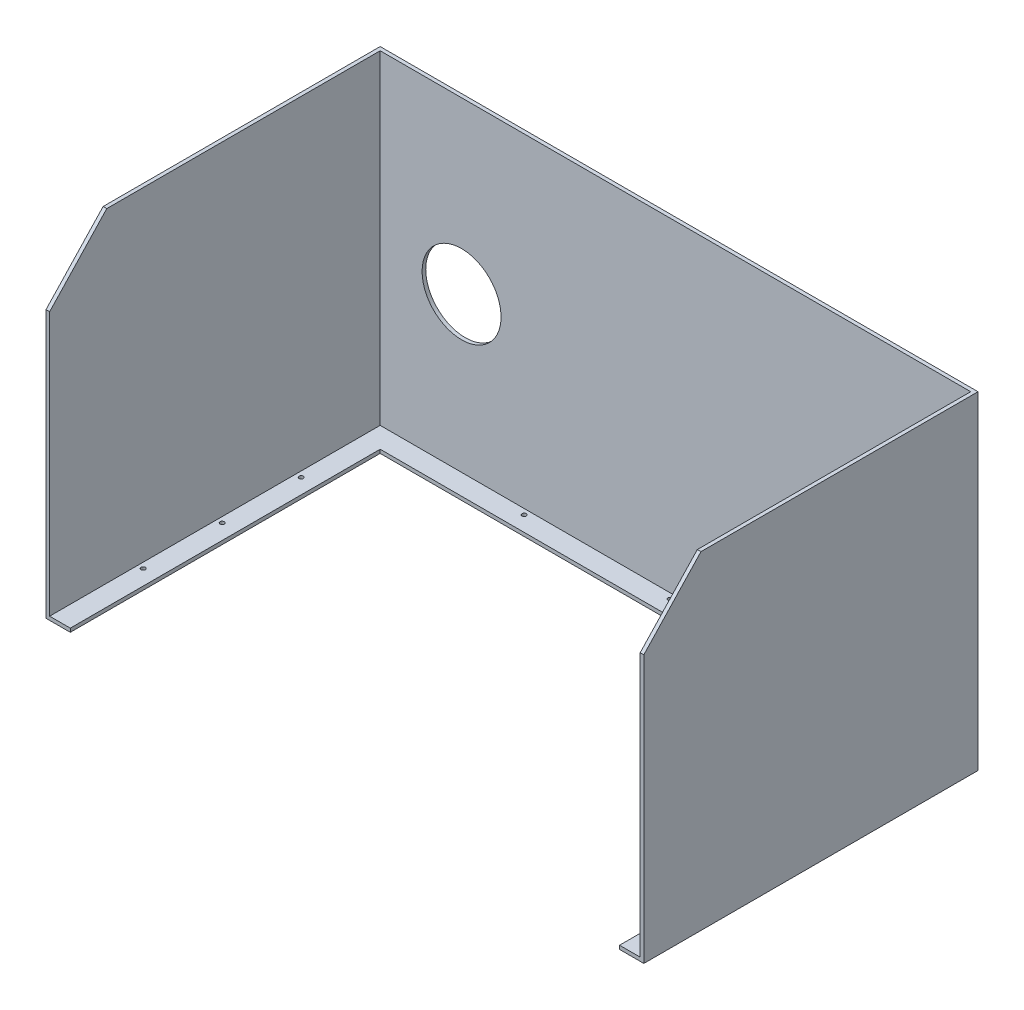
ISO-10303-21;
HEADER;
FILE_DESCRIPTION(('STEP AP214'),'2;1');
FILE_NAME('part.step','',(''),(''),'','','');
FILE_SCHEMA(('AUTOMOTIVE_DESIGN { 1 0 10303 214 1 1 1 1 }'));
ENDSEC;
DATA;
#1=APPLICATION_CONTEXT('core data for automotive mechanical design processes');
#2=APPLICATION_PROTOCOL_DEFINITION('international standard','automotive_design',2000,#1);
#3=PRODUCT_CONTEXT('',#1,'mechanical');
#4=PRODUCT('Part','Part','',(#3));
#5=PRODUCT_RELATED_PRODUCT_CATEGORY('part','',(#4));
#6=PRODUCT_DEFINITION_FORMATION('','',#4);
#7=PRODUCT_DEFINITION_CONTEXT('part definition',#1,'design');
#8=PRODUCT_DEFINITION('design','',#6,#7);
#9=PRODUCT_DEFINITION_SHAPE('','',#8);
#10=(LENGTH_UNIT() NAMED_UNIT(*) SI_UNIT(.MILLI.,.METRE.));
#11=(NAMED_UNIT(*) PLANE_ANGLE_UNIT() SI_UNIT($,.RADIAN.));
#12=(NAMED_UNIT(*) SI_UNIT($,.STERADIAN.) SOLID_ANGLE_UNIT());
#13=UNCERTAINTY_MEASURE_WITH_UNIT(LENGTH_MEASURE(1.E-05),#10,'distance_accuracy_value','');
#14=(GEOMETRIC_REPRESENTATION_CONTEXT(3) GLOBAL_UNCERTAINTY_ASSIGNED_CONTEXT((#13)) GLOBAL_UNIT_ASSIGNED_CONTEXT((#10,
#11,#12)) REPRESENTATION_CONTEXT('',''));
#15=CARTESIAN_POINT('',(0.,0.,0.));
#16=DIRECTION('',(0.,0.,1.));
#17=DIRECTION('',(1.,0.,0.));
#18=AXIS2_PLACEMENT_3D('',#15,#16,#17);
#19=CARTESIAN_POINT('',(-246.,135.,3.));
#20=DIRECTION('',(1.,0.,0.));
#21=DIRECTION('',(0.,1.,0.));
#22=AXIS2_PLACEMENT_3D('',#19,#20,#21);
#23=PLANE('',#22);
#24=DIRECTION('',(0.,-1.,0.));
#25=VECTOR('',#24,1.);
#26=CARTESIAN_POINT('',(-246.,135.,0.));
#27=LINE('',#26,#25);
#28=CARTESIAN_POINT('',(-246.,135.,0.));
#29=VERTEX_POINT('',#28);
#30=CARTESIAN_POINT('',(-246.,-135.,0.));
#31=VERTEX_POINT('',#30);
#32=EDGE_CURVE('E205',#29,#31,#27,.T.);
#33=ORIENTED_EDGE('',*,*,#32,.T.);
#34=DIRECTION('',(0.,0.,-1.));
#35=VECTOR('',#34,1.);
#36=CARTESIAN_POINT('',(-246.,-135.,3.));
#37=LINE('',#36,#35);
#38=CARTESIAN_POINT('',(-246.,-135.,275.));
#39=VERTEX_POINT('',#38);
#40=EDGE_CURVE('E11',#39,#31,#37,.T.);
#41=ORIENTED_EDGE('',*,*,#40,.F.);
#42=DIRECTION('',(0.,1.,0.));
#43=VECTOR('',#42,1.);
#44=CARTESIAN_POINT('',(-246.,-135.,275.));
#45=LINE('',#44,#43);
#46=CARTESIAN_POINT('',(-246.,84.9999999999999,275.));
#47=VERTEX_POINT('',#46);
#48=EDGE_CURVE('E182',#39,#47,#45,.T.);
#49=ORIENTED_EDGE('',*,*,#48,.T.);
#50=DIRECTION('',(0.,0.728627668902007,-0.684910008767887));
#51=VECTOR('',#50,1.);
#52=CARTESIAN_POINT('',(-246.,135.,228.));
#53=LINE('',#52,#51);
#54=CARTESIAN_POINT('',(-246.,135.,228.));
#55=VERTEX_POINT('',#54);
#56=EDGE_CURVE('E190',#47,#55,#53,.T.);
#57=ORIENTED_EDGE('',*,*,#56,.T.);
#58=DIRECTION('',(0.,0.,-1.));
#59=VECTOR('',#58,1.);
#60=CARTESIAN_POINT('',(-246.,135.,3.));
#61=LINE('',#60,#59);
#62=EDGE_CURVE('E212',#55,#29,#61,.T.);
#63=ORIENTED_EDGE('',*,*,#62,.T.);
#64=EDGE_LOOP('',(#33,#41,#49,#57,#63));
#65=FACE_BOUND('',#64,.T.);
#66=ADVANCED_FACE('F36',(#65),#23,.F.);
#67=CARTESIAN_POINT('',(246.,-135.,3.));
#68=DIRECTION('',(0.,1.,0.));
#69=DIRECTION('',(-1.,0.,0.));
#70=AXIS2_PLACEMENT_3D('',#67,#68,#69);
#71=PLANE('',#70);
#72=CARTESIAN_POINT('',(-238.5,-135.,137.5));
#73=DIRECTION('',(0.,-1.,0.));
#74=DIRECTION('',(1.,0.,0.));
#75=AXIS2_PLACEMENT_3D('',#72,#73,#74);
#76=CIRCLE('',#75,1.75000000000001);
#77=CARTESIAN_POINT('',(-236.75,-135.,137.5));
#78=VERTEX_POINT('',#77);
#79=EDGE_CURVE('E343',#78,#78,#76,.T.);
#80=ORIENTED_EDGE('',*,*,#79,.F.);
#81=EDGE_LOOP('',(#80));
#82=FACE_BOUND('',#81,.T.);
#83=CARTESIAN_POINT('',(-238.5,-135.,72.5));
#84=DIRECTION('',(0.,-1.,0.));
#85=DIRECTION('',(1.,0.,0.));
#86=AXIS2_PLACEMENT_3D('',#83,#84,#85);
#87=CIRCLE('',#86,1.75000000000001);
#88=CARTESIAN_POINT('',(-236.75,-135.,72.5));
#89=VERTEX_POINT('',#88);
#90=EDGE_CURVE('E337',#89,#89,#87,.T.);
#91=ORIENTED_EDGE('',*,*,#90,.F.);
#92=EDGE_LOOP('',(#91));
#93=FACE_BOUND('',#92,.T.);
#94=CARTESIAN_POINT('',(-120.,-135.,7.50000000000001));
#95=DIRECTION('',(0.,-1.,0.));
#96=DIRECTION('',(1.,0.,0.));
#97=AXIS2_PLACEMENT_3D('',#94,#95,#96);
#98=CIRCLE('',#97,1.75000000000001);
#99=CARTESIAN_POINT('',(-118.25,-135.,7.50000000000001));
#100=VERTEX_POINT('',#99);
#101=EDGE_CURVE('E331',#100,#100,#98,.T.);
#102=ORIENTED_EDGE('',*,*,#101,.F.);
#103=EDGE_LOOP('',(#102));
#104=FACE_BOUND('',#103,.T.);
#105=CARTESIAN_POINT('',(0.,-135.,7.5));
#106=DIRECTION('',(0.,-1.,0.));
#107=DIRECTION('',(1.,0.,0.));
#108=AXIS2_PLACEMENT_3D('',#105,#106,#107);
#109=CIRCLE('',#108,1.75);
#110=CARTESIAN_POINT('',(1.74999999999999,-135.,7.5));
#111=VERTEX_POINT('',#110);
#112=EDGE_CURVE('E314',#111,#111,#109,.T.);
#113=ORIENTED_EDGE('',*,*,#112,.F.);
#114=EDGE_LOOP('',(#113));
#115=FACE_BOUND('',#114,.T.);
#116=CARTESIAN_POINT('',(238.5,-135.,72.5));
#117=DIRECTION('',(0.,-1.,0.));
#118=DIRECTION('',(1.,0.,0.));
#119=AXIS2_PLACEMENT_3D('',#116,#117,#118);
#120=CIRCLE('',#119,1.75000000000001);
#121=CARTESIAN_POINT('',(240.25,-135.,72.5));
#122=VERTEX_POINT('',#121);
#123=EDGE_CURVE('E315',#122,#122,#120,.T.);
#124=ORIENTED_EDGE('',*,*,#123,.F.);
#125=EDGE_LOOP('',(#124));
#126=FACE_BOUND('',#125,.T.);
#127=CARTESIAN_POINT('',(238.5,-135.,137.5));
#128=DIRECTION('',(0.,-1.,0.));
#129=DIRECTION('',(1.,0.,0.));
#130=AXIS2_PLACEMENT_3D('',#127,#128,#129);
#131=CIRCLE('',#130,1.75000000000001);
#132=CARTESIAN_POINT('',(240.25,-135.,137.5));
#133=VERTEX_POINT('',#132);
#134=EDGE_CURVE('E321',#133,#133,#131,.T.);
#135=ORIENTED_EDGE('',*,*,#134,.F.);
#136=EDGE_LOOP('',(#135));
#137=FACE_BOUND('',#136,.T.);
#138=CARTESIAN_POINT('',(238.5,-135.,202.5));
#139=DIRECTION('',(0.,-1.,0.));
#140=DIRECTION('',(1.,0.,0.));
#141=AXIS2_PLACEMENT_3D('',#138,#139,#140);
#142=CIRCLE('',#141,1.75000000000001);
#143=CARTESIAN_POINT('',(240.25,-135.,202.5));
#144=VERTEX_POINT('',#143);
#145=EDGE_CURVE('E301',#144,#144,#142,.T.);
#146=ORIENTED_EDGE('',*,*,#145,.F.);
#147=EDGE_LOOP('',(#146));
#148=FACE_BOUND('',#147,.T.);
#149=CARTESIAN_POINT('',(120.,-135.,7.5));
#150=DIRECTION('',(0.,-1.,0.));
#151=DIRECTION('',(1.,0.,0.));
#152=AXIS2_PLACEMENT_3D('',#149,#150,#151);
#153=CIRCLE('',#152,1.75000000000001);
#154=CARTESIAN_POINT('',(121.75,-135.,7.5));
#155=VERTEX_POINT('',#154);
#156=EDGE_CURVE('E308',#155,#155,#153,.T.);
#157=ORIENTED_EDGE('',*,*,#156,.F.);
#158=EDGE_LOOP('',(#157));
#159=FACE_BOUND('',#158,.T.);
#160=CARTESIAN_POINT('',(-238.5,-135.,202.5));
#161=DIRECTION('',(0.,-1.,0.));
#162=DIRECTION('',(1.,0.,0.));
#163=AXIS2_PLACEMENT_3D('',#160,#161,#162);
#164=CIRCLE('',#163,1.75000000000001);
#165=CARTESIAN_POINT('',(-236.75,-135.,202.5));
#166=VERTEX_POINT('',#165);
#167=EDGE_CURVE('E295',#166,#166,#164,.T.);
#168=ORIENTED_EDGE('',*,*,#167,.F.);
#169=EDGE_LOOP('',(#168));
#170=FACE_BOUND('',#169,.T.);
#171=DIRECTION('',(0.,0.,1.));
#172=VECTOR('',#171,1.);
#173=CARTESIAN_POINT('',(-226.,-135.,275.));
#174=LINE('',#173,#172);
#175=CARTESIAN_POINT('',(-226.,-135.,20.));
#176=VERTEX_POINT('',#175);
#177=CARTESIAN_POINT('',(-226.,-135.,275.));
#178=VERTEX_POINT('',#177);
#179=EDGE_CURVE('E153',#176,#178,#174,.T.);
#180=ORIENTED_EDGE('',*,*,#179,.T.);
#181=DIRECTION('',(-1.,0.,0.));
#182=VECTOR('',#181,1.);
#183=CARTESIAN_POINT('',(-243.,-135.,275.));
#184=LINE('',#183,#182);
#185=EDGE_CURVE('E197',#178,#39,#184,.T.);
#186=ORIENTED_EDGE('',*,*,#185,.T.);
#187=ORIENTED_EDGE('',*,*,#40,.T.);
#188=DIRECTION('',(1.,0.,0.));
#189=VECTOR('',#188,1.);
#190=CARTESIAN_POINT('',(246.,-135.,0.));
#191=LINE('',#190,#189);
#192=CARTESIAN_POINT('',(246.,-135.,0.));
#193=VERTEX_POINT('',#192);
#194=EDGE_CURVE('E215',#31,#193,#191,.T.);
#195=ORIENTED_EDGE('',*,*,#194,.T.);
#196=DIRECTION('',(0.,0.,-1.));
#197=VECTOR('',#196,1.);
#198=CARTESIAN_POINT('',(246.,-135.,3.));
#199=LINE('',#198,#197);
#200=CARTESIAN_POINT('',(246.,-135.,275.));
#201=VERTEX_POINT('',#200);
#202=EDGE_CURVE('E43',#201,#193,#199,.T.);
#203=ORIENTED_EDGE('',*,*,#202,.F.);
#204=DIRECTION('',(1.,0.,0.));
#205=VECTOR('',#204,1.);
#206=CARTESIAN_POINT('',(243.,-135.,275.));
#207=LINE('',#206,#205);
#208=CARTESIAN_POINT('',(226.,-135.,275.));
#209=VERTEX_POINT('',#208);
#210=EDGE_CURVE('E179',#209,#201,#207,.T.);
#211=ORIENTED_EDGE('',*,*,#210,.F.);
#212=DIRECTION('',(0.,0.,-1.));
#213=VECTOR('',#212,1.);
#214=CARTESIAN_POINT('',(226.,-135.,275.));
#215=LINE('',#214,#213);
#216=CARTESIAN_POINT('',(226.,-135.,20.));
#217=VERTEX_POINT('',#216);
#218=EDGE_CURVE('E253',#209,#217,#215,.T.);
#219=ORIENTED_EDGE('',*,*,#218,.T.);
#220=DIRECTION('',(-1.,0.,0.));
#221=VECTOR('',#220,1.);
#222=CARTESIAN_POINT('',(226.,-135.,20.));
#223=LINE('',#222,#221);
#224=EDGE_CURVE('E255',#217,#176,#223,.T.);
#225=ORIENTED_EDGE('',*,*,#224,.T.);
#226=EDGE_LOOP('',(#180,#186,#187,#195,#203,#211,#219,#225));
#227=FACE_BOUND('',#226,.T.);
#228=ADVANCED_FACE('F251',(#82,#93,#104,#115,#126,#137,#148,#159,#170,#227),#71,.F.);
#229=CARTESIAN_POINT('',(246.,135.,3.));
#230=DIRECTION('',(-1.,0.,0.));
#231=DIRECTION('',(0.,-1.,0.));
#232=AXIS2_PLACEMENT_3D('',#229,#230,#231);
#233=PLANE('',#232);
#234=DIRECTION('',(0.,1.,0.));
#235=VECTOR('',#234,1.);
#236=CARTESIAN_POINT('',(246.,135.,0.));
#237=LINE('',#236,#235);
#238=CARTESIAN_POINT('',(246.,135.,0.));
#239=VERTEX_POINT('',#238);
#240=EDGE_CURVE('E217',#193,#239,#237,.T.);
#241=ORIENTED_EDGE('',*,*,#240,.T.);
#242=DIRECTION('',(0.,0.,-1.));
#243=VECTOR('',#242,1.);
#244=CARTESIAN_POINT('',(246.,135.,3.));
#245=LINE('',#244,#243);
#246=CARTESIAN_POINT('',(246.,135.,228.));
#247=VERTEX_POINT('',#246);
#248=EDGE_CURVE('E221',#247,#239,#245,.T.);
#249=ORIENTED_EDGE('',*,*,#248,.F.);
#250=DIRECTION('',(0.,-0.728627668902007,0.684910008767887));
#251=VECTOR('',#250,1.);
#252=CARTESIAN_POINT('',(246.,85.,275.));
#253=LINE('',#252,#251);
#254=CARTESIAN_POINT('',(246.,85.,275.));
#255=VERTEX_POINT('',#254);
#256=EDGE_CURVE('E165',#247,#255,#253,.T.);
#257=ORIENTED_EDGE('',*,*,#256,.T.);
#258=DIRECTION('',(0.,-1.,0.));
#259=VECTOR('',#258,1.);
#260=CARTESIAN_POINT('',(246.,-135.,275.));
#261=LINE('',#260,#259);
#262=EDGE_CURVE('E160',#255,#201,#261,.T.);
#263=ORIENTED_EDGE('',*,*,#262,.T.);
#264=ORIENTED_EDGE('',*,*,#202,.T.);
#265=EDGE_LOOP('',(#241,#249,#257,#263,#264));
#266=FACE_BOUND('',#265,.T.);
#267=ADVANCED_FACE('F225',(#266),#233,.F.);
#268=CARTESIAN_POINT('',(246.,135.,3.));
#269=DIRECTION('',(0.,-1.,0.));
#270=DIRECTION('',(1.,0.,0.));
#271=AXIS2_PLACEMENT_3D('',#268,#269,#270);
#272=PLANE('',#271);
#273=DIRECTION('',(-1.,0.,0.));
#274=VECTOR('',#273,1.);
#275=CARTESIAN_POINT('',(246.,135.,0.));
#276=LINE('',#275,#274);
#277=EDGE_CURVE('E58',#239,#29,#276,.T.);
#278=ORIENTED_EDGE('',*,*,#277,.T.);
#279=ORIENTED_EDGE('',*,*,#62,.F.);
#280=DIRECTION('',(-1.,0.,0.));
#281=VECTOR('',#280,1.);
#282=CARTESIAN_POINT('',(-243.,135.,228.));
#283=LINE('',#282,#281);
#284=CARTESIAN_POINT('',(-243.,135.,228.));
#285=VERTEX_POINT('',#284);
#286=EDGE_CURVE('E202',#285,#55,#283,.T.);
#287=ORIENTED_EDGE('',*,*,#286,.F.);
#288=DIRECTION('',(0.,0.,-1.));
#289=VECTOR('',#288,1.);
#290=CARTESIAN_POINT('',(-243.,135.,3.));
#291=LINE('',#290,#289);
#292=CARTESIAN_POINT('',(-243.,135.,3.));
#293=VERTEX_POINT('',#292);
#294=EDGE_CURVE('E187',#285,#293,#291,.T.);
#295=ORIENTED_EDGE('',*,*,#294,.T.);
#296=DIRECTION('',(-1.,0.,0.));
#297=VECTOR('',#296,1.);
#298=CARTESIAN_POINT('',(246.,135.,3.));
#299=LINE('',#298,#297);
#300=CARTESIAN_POINT('',(243.,135.,3.));
#301=VERTEX_POINT('',#300);
#302=EDGE_CURVE('E210',#301,#293,#299,.T.);
#303=ORIENTED_EDGE('',*,*,#302,.F.);
#304=DIRECTION('',(0.,0.,1.));
#305=VECTOR('',#304,1.);
#306=CARTESIAN_POINT('',(243.,135.,228.));
#307=LINE('',#306,#305);
#308=CARTESIAN_POINT('',(243.,135.,228.));
#309=VERTEX_POINT('',#308);
#310=EDGE_CURVE('E159',#301,#309,#307,.T.);
#311=ORIENTED_EDGE('',*,*,#310,.T.);
#312=DIRECTION('',(1.,0.,0.));
#313=VECTOR('',#312,1.);
#314=CARTESIAN_POINT('',(243.,135.,228.));
#315=LINE('',#314,#313);
#316=EDGE_CURVE('E175',#309,#247,#315,.T.);
#317=ORIENTED_EDGE('',*,*,#316,.T.);
#318=ORIENTED_EDGE('',*,*,#248,.T.);
#319=EDGE_LOOP('',(#278,#279,#287,#295,#303,#311,#317,#318));
#320=FACE_BOUND('',#319,.T.);
#321=ADVANCED_FACE('F233',(#320),#272,.F.);
#322=CARTESIAN_POINT('',(0.,0.,3.));
#323=DIRECTION('',(0.,0.,-1.));
#324=DIRECTION('',(-1.,0.,0.));
#325=AXIS2_PLACEMENT_3D('',#322,#323,#324);
#326=PLANE('',#325);
#327=CARTESIAN_POINT('',(-176.,-5.,3.));
#328=DIRECTION('',(0.,0.,-1.));
#329=DIRECTION('',(-1.,0.,0.));
#330=AXIS2_PLACEMENT_3D('',#327,#328,#329);
#331=CIRCLE('',#330,32.5);
#332=CARTESIAN_POINT('',(-208.5,-5.,3.));
#333=VERTEX_POINT('',#332);
#334=EDGE_CURVE('E287',#333,#333,#331,.T.);
#335=ORIENTED_EDGE('',*,*,#334,.T.);
#336=EDGE_LOOP('',(#335));
#337=FACE_BOUND('',#336,.T.);
#338=CARTESIAN_POINT('',(176.,-5.,3.));
#339=DIRECTION('',(0.,0.,-1.));
#340=DIRECTION('',(-1.,0.,0.));
#341=AXIS2_PLACEMENT_3D('',#338,#339,#340);
#342=CIRCLE('',#341,20.);
#343=CARTESIAN_POINT('',(156.,-5.,3.));
#344=VERTEX_POINT('',#343);
#345=EDGE_CURVE('E257',#344,#344,#342,.T.);
#346=ORIENTED_EDGE('',*,*,#345,.T.);
#347=EDGE_LOOP('',(#346));
#348=FACE_BOUND('',#347,.T.);
#349=DIRECTION('',(0.,-1.,0.));
#350=VECTOR('',#349,1.);
#351=CARTESIAN_POINT('',(-243.,135.,3.));
#352=LINE('',#351,#350);
#353=CARTESIAN_POINT('',(-243.,-132.,3.));
#354=VERTEX_POINT('',#353);
#355=EDGE_CURVE('E152',#293,#354,#352,.T.);
#356=ORIENTED_EDGE('',*,*,#355,.T.);
#357=DIRECTION('',(1.,0.,0.));
#358=VECTOR('',#357,1.);
#359=CARTESIAN_POINT('',(-243.,-132.,3.));
#360=LINE('',#359,#358);
#361=CARTESIAN_POINT('',(243.,-132.,3.));
#362=VERTEX_POINT('',#361);
#363=EDGE_CURVE('E140',#354,#362,#360,.T.);
#364=ORIENTED_EDGE('',*,*,#363,.T.);
#365=DIRECTION('',(0.,1.,0.));
#366=VECTOR('',#365,1.);
#367=CARTESIAN_POINT('',(243.,-135.,3.));
#368=LINE('',#367,#366);
#369=EDGE_CURVE('E50',#362,#301,#368,.T.);
#370=ORIENTED_EDGE('',*,*,#369,.T.);
#371=ORIENTED_EDGE('',*,*,#302,.T.);
#372=EDGE_LOOP('',(#356,#364,#370,#371));
#373=FACE_BOUND('',#372,.T.);
#374=ADVANCED_FACE('F150',(#337,#348,#373),#326,.F.);
#375=CARTESIAN_POINT('',(0.,0.,0.));
#376=DIRECTION('',(0.,0.,-1.));
#377=DIRECTION('',(-1.,0.,0.));
#378=AXIS2_PLACEMENT_3D('',#375,#376,#377);
#379=PLANE('',#378);
#380=CARTESIAN_POINT('',(-176.,-5.,0.));
#381=DIRECTION('',(0.,0.,-1.));
#382=DIRECTION('',(-1.,0.,0.));
#383=AXIS2_PLACEMENT_3D('',#380,#381,#382);
#384=CIRCLE('',#383,32.5);
#385=CARTESIAN_POINT('',(-208.5,-5.,0.));
#386=VERTEX_POINT('',#385);
#387=EDGE_CURVE('E289',#386,#386,#384,.T.);
#388=ORIENTED_EDGE('',*,*,#387,.F.);
#389=EDGE_LOOP('',(#388));
#390=FACE_BOUND('',#389,.T.);
#391=CARTESIAN_POINT('',(176.,-5.,0.));
#392=DIRECTION('',(0.,0.,-1.));
#393=DIRECTION('',(-1.,0.,0.));
#394=AXIS2_PLACEMENT_3D('',#391,#392,#393);
#395=CIRCLE('',#394,20.);
#396=CARTESIAN_POINT('',(156.,-5.,0.));
#397=VERTEX_POINT('',#396);
#398=EDGE_CURVE('E261',#397,#397,#395,.T.);
#399=ORIENTED_EDGE('',*,*,#398,.F.);
#400=EDGE_LOOP('',(#399));
#401=FACE_BOUND('',#400,.T.);
#402=ORIENTED_EDGE('',*,*,#32,.F.);
#403=ORIENTED_EDGE('',*,*,#277,.F.);
#404=ORIENTED_EDGE('',*,*,#240,.F.);
#405=ORIENTED_EDGE('',*,*,#194,.F.);
#406=EDGE_LOOP('',(#402,#403,#404,#405));
#407=FACE_BOUND('',#406,.T.);
#408=ADVANCED_FACE('F230',(#390,#401,#407),#379,.T.);
#409=CARTESIAN_POINT('',(-243.,135.,228.));
#410=DIRECTION('',(0.,0.684910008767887,0.728627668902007));
#411=DIRECTION('',(0.,-0.728627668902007,0.684910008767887));
#412=AXIS2_PLACEMENT_3D('',#409,#410,#411);
#413=PLANE('',#412);
#414=ORIENTED_EDGE('',*,*,#56,.F.);
#415=DIRECTION('',(-1.,0.,0.));
#416=VECTOR('',#415,1.);
#417=CARTESIAN_POINT('',(-243.,84.9999999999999,275.));
#418=LINE('',#417,#416);
#419=CARTESIAN_POINT('',(-243.,84.9999999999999,275.));
#420=VERTEX_POINT('',#419);
#421=EDGE_CURVE('E206',#420,#47,#418,.T.);
#422=ORIENTED_EDGE('',*,*,#421,.F.);
#423=DIRECTION('',(0.,0.728627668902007,-0.684910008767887));
#424=VECTOR('',#423,1.);
#425=CARTESIAN_POINT('',(-243.,135.,228.));
#426=LINE('',#425,#424);
#427=EDGE_CURVE('E194',#420,#285,#426,.T.);
#428=ORIENTED_EDGE('',*,*,#427,.T.);
#429=ORIENTED_EDGE('',*,*,#286,.T.);
#430=EDGE_LOOP('',(#414,#422,#428,#429));
#431=FACE_BOUND('',#430,.T.);
#432=ADVANCED_FACE('F236',(#431),#413,.T.);
#433=CARTESIAN_POINT('',(-243.,-135.,275.));
#434=DIRECTION('',(0.,0.,1.));
#435=DIRECTION('',(1.,0.,0.));
#436=AXIS2_PLACEMENT_3D('',#433,#434,#435);
#437=PLANE('',#436);
#438=ORIENTED_EDGE('',*,*,#48,.F.);
#439=ORIENTED_EDGE('',*,*,#185,.F.);
#440=DIRECTION('',(0.,-1.,0.));
#441=VECTOR('',#440,1.);
#442=CARTESIAN_POINT('',(-226.,-132.,275.));
#443=LINE('',#442,#441);
#444=CARTESIAN_POINT('',(-226.,-132.,275.));
#445=VERTEX_POINT('',#444);
#446=EDGE_CURVE('E177',#445,#178,#443,.T.);
#447=ORIENTED_EDGE('',*,*,#446,.F.);
#448=DIRECTION('',(-1.,0.,0.));
#449=VECTOR('',#448,1.);
#450=CARTESIAN_POINT('',(-243.,-132.,275.));
#451=LINE('',#450,#449);
#452=CARTESIAN_POINT('',(-243.,-132.,275.));
#453=VERTEX_POINT('',#452);
#454=EDGE_CURVE('E273',#445,#453,#451,.T.);
#455=ORIENTED_EDGE('',*,*,#454,.T.);
#456=DIRECTION('',(0.,1.,0.));
#457=VECTOR('',#456,1.);
#458=CARTESIAN_POINT('',(-243.,-135.,275.));
#459=LINE('',#458,#457);
#460=EDGE_CURVE('E192',#453,#420,#459,.T.);
#461=ORIENTED_EDGE('',*,*,#460,.T.);
#462=ORIENTED_EDGE('',*,*,#421,.T.);
#463=EDGE_LOOP('',(#438,#439,#447,#455,#461,#462));
#464=FACE_BOUND('',#463,.T.);
#465=ADVANCED_FACE('F438',(#464),#437,.T.);
#466=CARTESIAN_POINT('',(-243.,0.,0.));
#467=DIRECTION('',(-1.,0.,0.));
#468=DIRECTION('',(0.,-1.,0.));
#469=AXIS2_PLACEMENT_3D('',#466,#467,#468);
#470=PLANE('',#469);
#471=ORIENTED_EDGE('',*,*,#460,.F.);
#472=DIRECTION('',(0.,0.,-1.));
#473=VECTOR('',#472,1.);
#474=CARTESIAN_POINT('',(-243.,-132.,3.));
#475=LINE('',#474,#473);
#476=EDGE_CURVE('E264',#453,#354,#475,.T.);
#477=ORIENTED_EDGE('',*,*,#476,.T.);
#478=ORIENTED_EDGE('',*,*,#355,.F.);
#479=ORIENTED_EDGE('',*,*,#294,.F.);
#480=ORIENTED_EDGE('',*,*,#427,.F.);
#481=EDGE_LOOP('',(#471,#477,#478,#479,#480));
#482=FACE_BOUND('',#481,.T.);
#483=ADVANCED_FACE('F241',(#482),#470,.F.);
#484=CARTESIAN_POINT('',(243.,-135.,275.));
#485=DIRECTION('',(0.,0.,1.));
#486=DIRECTION('',(1.,0.,0.));
#487=AXIS2_PLACEMENT_3D('',#484,#485,#486);
#488=PLANE('',#487);
#489=ORIENTED_EDGE('',*,*,#262,.F.);
#490=DIRECTION('',(1.,0.,0.));
#491=VECTOR('',#490,1.);
#492=CARTESIAN_POINT('',(243.,85.,275.));
#493=LINE('',#492,#491);
#494=CARTESIAN_POINT('',(243.,85.,275.));
#495=VERTEX_POINT('',#494);
#496=EDGE_CURVE('E183',#495,#255,#493,.T.);
#497=ORIENTED_EDGE('',*,*,#496,.F.);
#498=DIRECTION('',(0.,-1.,0.));
#499=VECTOR('',#498,1.);
#500=CARTESIAN_POINT('',(243.,-135.,275.));
#501=LINE('',#500,#499);
#502=CARTESIAN_POINT('',(243.,-132.,275.));
#503=VERTEX_POINT('',#502);
#504=EDGE_CURVE('E173',#495,#503,#501,.T.);
#505=ORIENTED_EDGE('',*,*,#504,.T.);
#506=DIRECTION('',(-1.,0.,0.));
#507=VECTOR('',#506,1.);
#508=CARTESIAN_POINT('',(243.,-132.,275.));
#509=LINE('',#508,#507);
#510=CARTESIAN_POINT('',(226.,-132.,275.));
#511=VERTEX_POINT('',#510);
#512=EDGE_CURVE('E144',#503,#511,#509,.T.);
#513=ORIENTED_EDGE('',*,*,#512,.T.);
#514=DIRECTION('',(0.,-1.,0.));
#515=VECTOR('',#514,1.);
#516=CARTESIAN_POINT('',(226.,-132.,275.));
#517=LINE('',#516,#515);
#518=EDGE_CURVE('E168',#511,#209,#517,.T.);
#519=ORIENTED_EDGE('',*,*,#518,.T.);
#520=ORIENTED_EDGE('',*,*,#210,.T.);
#521=EDGE_LOOP('',(#489,#497,#505,#513,#519,#520));
#522=FACE_BOUND('',#521,.T.);
#523=ADVANCED_FACE('F246',(#522),#488,.T.);
#524=CARTESIAN_POINT('',(243.,85.,275.));
#525=DIRECTION('',(0.,0.684910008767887,0.728627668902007));
#526=DIRECTION('',(0.,-0.728627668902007,0.684910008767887));
#527=AXIS2_PLACEMENT_3D('',#524,#525,#526);
#528=PLANE('',#527);
#529=ORIENTED_EDGE('',*,*,#256,.F.);
#530=ORIENTED_EDGE('',*,*,#316,.F.);
#531=DIRECTION('',(0.,-0.728627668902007,0.684910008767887));
#532=VECTOR('',#531,1.);
#533=CARTESIAN_POINT('',(243.,85.,275.));
#534=LINE('',#533,#532);
#535=EDGE_CURVE('E162',#309,#495,#534,.T.);
#536=ORIENTED_EDGE('',*,*,#535,.T.);
#537=ORIENTED_EDGE('',*,*,#496,.T.);
#538=EDGE_LOOP('',(#529,#530,#536,#537));
#539=FACE_BOUND('',#538,.T.);
#540=ADVANCED_FACE('F244',(#539),#528,.T.);
#541=CARTESIAN_POINT('',(243.,0.,0.));
#542=DIRECTION('',(-1.,0.,0.));
#543=DIRECTION('',(0.,-1.,0.));
#544=AXIS2_PLACEMENT_3D('',#541,#542,#543);
#545=PLANE('',#544);
#546=DIRECTION('',(0.,0.,1.));
#547=VECTOR('',#546,1.);
#548=CARTESIAN_POINT('',(243.,-132.,275.));
#549=LINE('',#548,#547);
#550=EDGE_CURVE('E137',#362,#503,#549,.T.);
#551=ORIENTED_EDGE('',*,*,#550,.T.);
#552=ORIENTED_EDGE('',*,*,#504,.F.);
#553=ORIENTED_EDGE('',*,*,#535,.F.);
#554=ORIENTED_EDGE('',*,*,#310,.F.);
#555=ORIENTED_EDGE('',*,*,#369,.F.);
#556=EDGE_LOOP('',(#551,#552,#553,#554,#555));
#557=FACE_BOUND('',#556,.T.);
#558=ADVANCED_FACE('F156',(#557),#545,.T.);
#559=CARTESIAN_POINT('',(-226.,-132.,275.));
#560=DIRECTION('',(1.,0.,0.));
#561=DIRECTION('',(0.,0.,-1.));
#562=AXIS2_PLACEMENT_3D('',#559,#560,#561);
#563=PLANE('',#562);
#564=ORIENTED_EDGE('',*,*,#179,.F.);
#565=DIRECTION('',(0.,-1.,0.));
#566=VECTOR('',#565,1.);
#567=CARTESIAN_POINT('',(-226.,-132.,20.));
#568=LINE('',#567,#566);
#569=CARTESIAN_POINT('',(-226.,-132.,20.));
#570=VERTEX_POINT('',#569);
#571=EDGE_CURVE('E270',#570,#176,#568,.T.);
#572=ORIENTED_EDGE('',*,*,#571,.F.);
#573=DIRECTION('',(0.,0.,1.));
#574=VECTOR('',#573,1.);
#575=CARTESIAN_POINT('',(-226.,-132.,275.));
#576=LINE('',#575,#574);
#577=EDGE_CURVE('E274',#570,#445,#576,.T.);
#578=ORIENTED_EDGE('',*,*,#577,.T.);
#579=ORIENTED_EDGE('',*,*,#446,.T.);
#580=EDGE_LOOP('',(#564,#572,#578,#579));
#581=FACE_BOUND('',#580,.T.);
#582=ADVANCED_FACE('F468',(#581),#563,.T.);
#583=CARTESIAN_POINT('',(226.,-132.,20.));
#584=DIRECTION('',(0.,0.,1.));
#585=DIRECTION('',(1.,0.,0.));
#586=AXIS2_PLACEMENT_3D('',#583,#584,#585);
#587=PLANE('',#586);
#588=ORIENTED_EDGE('',*,*,#224,.F.);
#589=DIRECTION('',(0.,-1.,0.));
#590=VECTOR('',#589,1.);
#591=CARTESIAN_POINT('',(226.,-132.,20.));
#592=LINE('',#591,#590);
#593=CARTESIAN_POINT('',(226.,-132.,20.));
#594=VERTEX_POINT('',#593);
#595=EDGE_CURVE('E271',#594,#217,#592,.T.);
#596=ORIENTED_EDGE('',*,*,#595,.F.);
#597=DIRECTION('',(-1.,0.,0.));
#598=VECTOR('',#597,1.);
#599=CARTESIAN_POINT('',(226.,-132.,20.));
#600=LINE('',#599,#598);
#601=EDGE_CURVE('E278',#594,#570,#600,.T.);
#602=ORIENTED_EDGE('',*,*,#601,.T.);
#603=ORIENTED_EDGE('',*,*,#571,.T.);
#604=EDGE_LOOP('',(#588,#596,#602,#603));
#605=FACE_BOUND('',#604,.T.);
#606=ADVANCED_FACE('F475',(#605),#587,.T.);
#607=CARTESIAN_POINT('',(226.,-132.,275.));
#608=DIRECTION('',(-1.,0.,0.));
#609=DIRECTION('',(0.,-1.,0.));
#610=AXIS2_PLACEMENT_3D('',#607,#608,#609);
#611=PLANE('',#610);
#612=ORIENTED_EDGE('',*,*,#218,.F.);
#613=ORIENTED_EDGE('',*,*,#518,.F.);
#614=DIRECTION('',(0.,0.,-1.));
#615=VECTOR('',#614,1.);
#616=CARTESIAN_POINT('',(226.,-132.,275.));
#617=LINE('',#616,#615);
#618=EDGE_CURVE('E283',#511,#594,#617,.T.);
#619=ORIENTED_EDGE('',*,*,#618,.T.);
#620=ORIENTED_EDGE('',*,*,#595,.T.);
#621=EDGE_LOOP('',(#612,#613,#619,#620));
#622=FACE_BOUND('',#621,.T.);
#623=ADVANCED_FACE('F483',(#622),#611,.T.);
#624=CARTESIAN_POINT('',(0.,-132.,0.));
#625=DIRECTION('',(0.,1.,0.));
#626=DIRECTION('',(-1.,0.,0.));
#627=AXIS2_PLACEMENT_3D('',#624,#625,#626);
#628=PLANE('',#627);
#629=CARTESIAN_POINT('',(-238.5,-132.,137.5));
#630=DIRECTION('',(0.,-1.,0.));
#631=DIRECTION('',(1.,0.,0.));
#632=AXIS2_PLACEMENT_3D('',#629,#630,#631);
#633=CIRCLE('',#632,1.75000000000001);
#634=CARTESIAN_POINT('',(-236.75,-132.,137.5));
#635=VERTEX_POINT('',#634);
#636=EDGE_CURVE('E298',#635,#635,#633,.T.);
#637=ORIENTED_EDGE('',*,*,#636,.T.);
#638=EDGE_LOOP('',(#637));
#639=FACE_BOUND('',#638,.T.);
#640=CARTESIAN_POINT('',(-238.5,-132.,72.5));
#641=DIRECTION('',(0.,-1.,0.));
#642=DIRECTION('',(1.,0.,0.));
#643=AXIS2_PLACEMENT_3D('',#640,#641,#642);
#644=CIRCLE('',#643,1.75000000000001);
#645=CARTESIAN_POINT('',(-236.75,-132.,72.5));
#646=VERTEX_POINT('',#645);
#647=EDGE_CURVE('E340',#646,#646,#644,.T.);
#648=ORIENTED_EDGE('',*,*,#647,.T.);
#649=EDGE_LOOP('',(#648));
#650=FACE_BOUND('',#649,.T.);
#651=CARTESIAN_POINT('',(-120.,-132.,7.50000000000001));
#652=DIRECTION('',(0.,-1.,0.));
#653=DIRECTION('',(1.,0.,0.));
#654=AXIS2_PLACEMENT_3D('',#651,#652,#653);
#655=CIRCLE('',#654,1.75000000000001);
#656=CARTESIAN_POINT('',(-118.25,-132.,7.50000000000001));
#657=VERTEX_POINT('',#656);
#658=EDGE_CURVE('E334',#657,#657,#655,.T.);
#659=ORIENTED_EDGE('',*,*,#658,.T.);
#660=EDGE_LOOP('',(#659));
#661=FACE_BOUND('',#660,.T.);
#662=CARTESIAN_POINT('',(0.,-132.,7.5));
#663=DIRECTION('',(0.,-1.,0.));
#664=DIRECTION('',(1.,0.,0.));
#665=AXIS2_PLACEMENT_3D('',#662,#663,#664);
#666=CIRCLE('',#665,1.75);
#667=CARTESIAN_POINT('',(1.74999999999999,-132.,7.5));
#668=VERTEX_POINT('',#667);
#669=EDGE_CURVE('E328',#668,#668,#666,.T.);
#670=ORIENTED_EDGE('',*,*,#669,.T.);
#671=EDGE_LOOP('',(#670));
#672=FACE_BOUND('',#671,.T.);
#673=CARTESIAN_POINT('',(238.5,-132.,72.5));
#674=DIRECTION('',(0.,-1.,0.));
#675=DIRECTION('',(1.,0.,0.));
#676=AXIS2_PLACEMENT_3D('',#673,#674,#675);
#677=CIRCLE('',#676,1.75000000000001);
#678=CARTESIAN_POINT('',(240.25,-132.,72.5));
#679=VERTEX_POINT('',#678);
#680=EDGE_CURVE('E318',#679,#679,#677,.T.);
#681=ORIENTED_EDGE('',*,*,#680,.T.);
#682=EDGE_LOOP('',(#681));
#683=FACE_BOUND('',#682,.T.);
#684=CARTESIAN_POINT('',(238.5,-132.,137.5));
#685=DIRECTION('',(0.,-1.,0.));
#686=DIRECTION('',(1.,0.,0.));
#687=AXIS2_PLACEMENT_3D('',#684,#685,#686);
#688=CIRCLE('',#687,1.75000000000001);
#689=CARTESIAN_POINT('',(240.25,-132.,137.5));
#690=VERTEX_POINT('',#689);
#691=EDGE_CURVE('E305',#690,#690,#688,.T.);
#692=ORIENTED_EDGE('',*,*,#691,.T.);
#693=EDGE_LOOP('',(#692));
#694=FACE_BOUND('',#693,.T.);
#695=CARTESIAN_POINT('',(238.5,-132.,202.5));
#696=DIRECTION('',(0.,-1.,0.));
#697=DIRECTION('',(1.,0.,0.));
#698=AXIS2_PLACEMENT_3D('',#695,#696,#697);
#699=CIRCLE('',#698,1.75000000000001);
#700=CARTESIAN_POINT('',(240.25,-132.,202.5));
#701=VERTEX_POINT('',#700);
#702=EDGE_CURVE('E304',#701,#701,#699,.T.);
#703=ORIENTED_EDGE('',*,*,#702,.T.);
#704=EDGE_LOOP('',(#703));
#705=FACE_BOUND('',#704,.T.);
#706=CARTESIAN_POINT('',(120.,-132.,7.5));
#707=DIRECTION('',(0.,-1.,0.));
#708=DIRECTION('',(1.,0.,0.));
#709=AXIS2_PLACEMENT_3D('',#706,#707,#708);
#710=CIRCLE('',#709,1.75000000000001);
#711=CARTESIAN_POINT('',(121.75,-132.,7.5));
#712=VERTEX_POINT('',#711);
#713=EDGE_CURVE('E311',#712,#712,#710,.T.);
#714=ORIENTED_EDGE('',*,*,#713,.T.);
#715=EDGE_LOOP('',(#714));
#716=FACE_BOUND('',#715,.T.);
#717=CARTESIAN_POINT('',(-238.5,-132.,202.5));
#718=DIRECTION('',(0.,-1.,0.));
#719=DIRECTION('',(1.,0.,0.));
#720=AXIS2_PLACEMENT_3D('',#717,#718,#719);
#721=CIRCLE('',#720,1.75000000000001);
#722=CARTESIAN_POINT('',(-236.75,-132.,202.5));
#723=VERTEX_POINT('',#722);
#724=EDGE_CURVE('E292',#723,#723,#721,.T.);
#725=ORIENTED_EDGE('',*,*,#724,.T.);
#726=EDGE_LOOP('',(#725));
#727=FACE_BOUND('',#726,.T.);
#728=ORIENTED_EDGE('',*,*,#363,.F.);
#729=ORIENTED_EDGE('',*,*,#476,.F.);
#730=ORIENTED_EDGE('',*,*,#454,.F.);
#731=ORIENTED_EDGE('',*,*,#577,.F.);
#732=ORIENTED_EDGE('',*,*,#601,.F.);
#733=ORIENTED_EDGE('',*,*,#618,.F.);
#734=ORIENTED_EDGE('',*,*,#512,.F.);
#735=ORIENTED_EDGE('',*,*,#550,.F.);
#736=EDGE_LOOP('',(#728,#729,#730,#731,#732,#733,#734,#735));
#737=FACE_BOUND('',#736,.T.);
#738=ADVANCED_FACE('F138',(#639,#650,#661,#672,#683,#694,#705,#716,#727,#737),#628,.T.);
#739=CARTESIAN_POINT('',(176.,-5.,3.));
#740=DIRECTION('',(0.,0.,-1.));
#741=DIRECTION('',(-1.,0.,0.));
#742=AXIS2_PLACEMENT_3D('',#739,#740,#741);
#743=CYLINDRICAL_SURFACE('',#742,20.);
#744=ORIENTED_EDGE('',*,*,#345,.F.);
#745=EDGE_LOOP('',(#744));
#746=FACE_BOUND('',#745,.T.);
#747=ORIENTED_EDGE('',*,*,#398,.T.);
#748=EDGE_LOOP('',(#747));
#749=FACE_BOUND('',#748,.T.);
#750=ADVANCED_FACE('F389',(#746,#749),#743,.F.);
#751=CARTESIAN_POINT('',(-176.,-5.,3.));
#752=DIRECTION('',(0.,0.,-1.));
#753=DIRECTION('',(-1.,0.,0.));
#754=AXIS2_PLACEMENT_3D('',#751,#752,#753);
#755=CYLINDRICAL_SURFACE('',#754,32.5);
#756=ORIENTED_EDGE('',*,*,#334,.F.);
#757=EDGE_LOOP('',(#756));
#758=FACE_BOUND('',#757,.T.);
#759=ORIENTED_EDGE('',*,*,#387,.T.);
#760=EDGE_LOOP('',(#759));
#761=FACE_BOUND('',#760,.T.);
#762=ADVANCED_FACE('F379',(#758,#761),#755,.F.);
#763=CARTESIAN_POINT('',(-238.5,-132.,202.5));
#764=DIRECTION('',(0.,-1.,0.));
#765=DIRECTION('',(1.,0.,0.));
#766=AXIS2_PLACEMENT_3D('',#763,#764,#765);
#767=CYLINDRICAL_SURFACE('',#766,1.75000000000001);
#768=ORIENTED_EDGE('',*,*,#724,.F.);
#769=EDGE_LOOP('',(#768));
#770=FACE_BOUND('',#769,.T.);
#771=ORIENTED_EDGE('',*,*,#167,.T.);
#772=EDGE_LOOP('',(#771));
#773=FACE_BOUND('',#772,.T.);
#774=ADVANCED_FACE('F376',(#770,#773),#767,.F.);
#775=CARTESIAN_POINT('',(120.,-132.,7.5));
#776=DIRECTION('',(0.,-1.,0.));
#777=DIRECTION('',(1.,0.,0.));
#778=AXIS2_PLACEMENT_3D('',#775,#776,#777);
#779=CYLINDRICAL_SURFACE('',#778,1.75000000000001);
#780=ORIENTED_EDGE('',*,*,#713,.F.);
#781=EDGE_LOOP('',(#780));
#782=FACE_BOUND('',#781,.T.);
#783=ORIENTED_EDGE('',*,*,#156,.T.);
#784=EDGE_LOOP('',(#783));
#785=FACE_BOUND('',#784,.T.);
#786=ADVANCED_FACE('F378',(#782,#785),#779,.F.);
#787=CARTESIAN_POINT('',(238.5,-132.,202.5));
#788=DIRECTION('',(0.,-1.,0.));
#789=DIRECTION('',(1.,0.,0.));
#790=AXIS2_PLACEMENT_3D('',#787,#788,#789);
#791=CYLINDRICAL_SURFACE('',#790,1.75000000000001);
#792=ORIENTED_EDGE('',*,*,#702,.F.);
#793=EDGE_LOOP('',(#792));
#794=FACE_BOUND('',#793,.T.);
#795=ORIENTED_EDGE('',*,*,#145,.T.);
#796=EDGE_LOOP('',(#795));
#797=FACE_BOUND('',#796,.T.);
#798=ADVANCED_FACE('F386',(#794,#797),#791,.F.);
#799=CARTESIAN_POINT('',(238.5,-132.,137.5));
#800=DIRECTION('',(0.,-1.,0.));
#801=DIRECTION('',(1.,0.,0.));
#802=AXIS2_PLACEMENT_3D('',#799,#800,#801);
#803=CYLINDRICAL_SURFACE('',#802,1.75000000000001);
#804=ORIENTED_EDGE('',*,*,#691,.F.);
#805=EDGE_LOOP('',(#804));
#806=FACE_BOUND('',#805,.T.);
#807=ORIENTED_EDGE('',*,*,#134,.T.);
#808=EDGE_LOOP('',(#807));
#809=FACE_BOUND('',#808,.T.);
#810=ADVANCED_FACE('F525',(#806,#809),#803,.F.);
#811=CARTESIAN_POINT('',(238.5,-132.,72.5));
#812=DIRECTION('',(0.,-1.,0.));
#813=DIRECTION('',(1.,0.,0.));
#814=AXIS2_PLACEMENT_3D('',#811,#812,#813);
#815=CYLINDRICAL_SURFACE('',#814,1.75000000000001);
#816=ORIENTED_EDGE('',*,*,#680,.F.);
#817=EDGE_LOOP('',(#816));
#818=FACE_BOUND('',#817,.T.);
#819=ORIENTED_EDGE('',*,*,#123,.T.);
#820=EDGE_LOOP('',(#819));
#821=FACE_BOUND('',#820,.T.);
#822=ADVANCED_FACE('F533',(#818,#821),#815,.F.);
#823=CARTESIAN_POINT('',(0.,-132.,7.5));
#824=DIRECTION('',(0.,-1.,0.));
#825=DIRECTION('',(1.,0.,0.));
#826=AXIS2_PLACEMENT_3D('',#823,#824,#825);
#827=CYLINDRICAL_SURFACE('',#826,1.75);
#828=ORIENTED_EDGE('',*,*,#669,.F.);
#829=EDGE_LOOP('',(#828));
#830=FACE_BOUND('',#829,.T.);
#831=ORIENTED_EDGE('',*,*,#112,.T.);
#832=EDGE_LOOP('',(#831));
#833=FACE_BOUND('',#832,.T.);
#834=ADVANCED_FACE('F542',(#830,#833),#827,.F.);
#835=CARTESIAN_POINT('',(-120.,-132.,7.50000000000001));
#836=DIRECTION('',(0.,-1.,0.));
#837=DIRECTION('',(1.,0.,0.));
#838=AXIS2_PLACEMENT_3D('',#835,#836,#837);
#839=CYLINDRICAL_SURFACE('',#838,1.75000000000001);
#840=ORIENTED_EDGE('',*,*,#658,.F.);
#841=EDGE_LOOP('',(#840));
#842=FACE_BOUND('',#841,.T.);
#843=ORIENTED_EDGE('',*,*,#101,.T.);
#844=EDGE_LOOP('',(#843));
#845=FACE_BOUND('',#844,.T.);
#846=ADVANCED_FACE('F551',(#842,#845),#839,.F.);
#847=CARTESIAN_POINT('',(-238.5,-132.,72.5));
#848=DIRECTION('',(0.,-1.,0.));
#849=DIRECTION('',(1.,0.,0.));
#850=AXIS2_PLACEMENT_3D('',#847,#848,#849);
#851=CYLINDRICAL_SURFACE('',#850,1.75000000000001);
#852=ORIENTED_EDGE('',*,*,#647,.F.);
#853=EDGE_LOOP('',(#852));
#854=FACE_BOUND('',#853,.T.);
#855=ORIENTED_EDGE('',*,*,#90,.T.);
#856=EDGE_LOOP('',(#855));
#857=FACE_BOUND('',#856,.T.);
#858=ADVANCED_FACE('F354',(#854,#857),#851,.F.);
#859=CARTESIAN_POINT('',(-238.5,-132.,137.5));
#860=DIRECTION('',(0.,-1.,0.));
#861=DIRECTION('',(1.,0.,0.));
#862=AXIS2_PLACEMENT_3D('',#859,#860,#861);
#863=CYLINDRICAL_SURFACE('',#862,1.75000000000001);
#864=ORIENTED_EDGE('',*,*,#636,.F.);
#865=EDGE_LOOP('',(#864));
#866=FACE_BOUND('',#865,.T.);
#867=ORIENTED_EDGE('',*,*,#79,.T.);
#868=EDGE_LOOP('',(#867));
#869=FACE_BOUND('',#868,.T.);
#870=ADVANCED_FACE('F351',(#866,#869),#863,.F.);
#871=CLOSED_SHELL('',(#66,#228,#267,#321,#374,#408,#432,#465,#483,#523,#540,#558,#582,#606,#623,
#738,#750,#762,#774,#786,#798,#810,#822,#834,#846,#858,#870));
#872=MANIFOLD_SOLID_BREP('B2',#871);
#873=ADVANCED_BREP_SHAPE_REPRESENTATION('',(#18,#872),#14);
#874=SHAPE_DEFINITION_REPRESENTATION(#9,#873);
ENDSEC;
END-ISO-10303-21;
